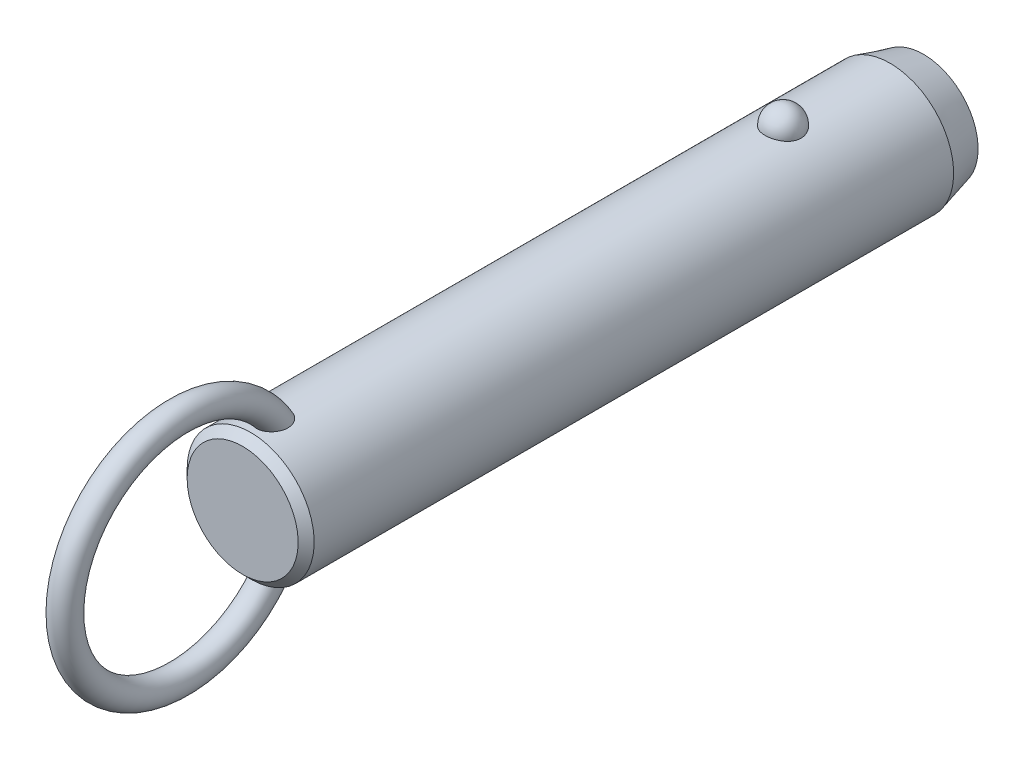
ISO-10303-21;
HEADER;
FILE_DESCRIPTION(('STEP AP214'),'2;1');
FILE_NAME('part.step','',(''),(''),'','','');
FILE_SCHEMA(('AUTOMOTIVE_DESIGN { 1 0 10303 214 1 1 1 1 }'));
ENDSEC;
DATA;
#1=APPLICATION_CONTEXT('core data for automotive mechanical design processes');
#2=APPLICATION_PROTOCOL_DEFINITION('international standard','automotive_design',2000,#1);
#3=PRODUCT_CONTEXT('',#1,'mechanical');
#4=PRODUCT('Part','Part','',(#3));
#5=PRODUCT_RELATED_PRODUCT_CATEGORY('part','',(#4));
#6=PRODUCT_DEFINITION_FORMATION('','',#4);
#7=PRODUCT_DEFINITION_CONTEXT('part definition',#1,'design');
#8=PRODUCT_DEFINITION('design','',#6,#7);
#9=PRODUCT_DEFINITION_SHAPE('','',#8);
#10=(LENGTH_UNIT() NAMED_UNIT(*) SI_UNIT(.MILLI.,.METRE.));
#11=(NAMED_UNIT(*) PLANE_ANGLE_UNIT() SI_UNIT($,.RADIAN.));
#12=(NAMED_UNIT(*) SI_UNIT($,.STERADIAN.) SOLID_ANGLE_UNIT());
#13=UNCERTAINTY_MEASURE_WITH_UNIT(LENGTH_MEASURE(1.E-05),#10,'distance_accuracy_value','');
#14=(GEOMETRIC_REPRESENTATION_CONTEXT(3) GLOBAL_UNCERTAINTY_ASSIGNED_CONTEXT((#13)) GLOBAL_UNIT_ASSIGNED_CONTEXT((#10,
#11,#12)) REPRESENTATION_CONTEXT('',''));
#15=CARTESIAN_POINT('',(0.,0.,0.));
#16=DIRECTION('',(0.,0.,1.));
#17=DIRECTION('',(1.,0.,0.));
#18=AXIS2_PLACEMENT_3D('',#15,#16,#17);
#19=CARTESIAN_POINT('',(0.,0.,68.6));
#20=DIRECTION('',(0.,0.,-1.));
#21=DIRECTION('',(-1.,0.,0.));
#22=AXIS2_PLACEMENT_3D('',#19,#20,#21);
#23=CYLINDRICAL_SURFACE('',#22,9.5);
#24=CARTESIAN_POINT('',(2.67259918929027,9.11631578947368,-2.70000000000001));
#25=CARTESIAN_POINT('',(2.6725968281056,9.11631786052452,-2.54909854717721));
#26=CARTESIAN_POINT('',(2.66030567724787,9.11994722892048,-2.39816735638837));
#27=CARTESIAN_POINT('',(2.6114347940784,9.13405924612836,-2.10058568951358));
#28=CARTESIAN_POINT('',(2.57484658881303,9.14454428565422,-1.95393672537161));
#29=CARTESIAN_POINT('',(2.47830875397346,9.17117631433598,-1.66916069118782));
#30=CARTESIAN_POINT('',(2.41836936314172,9.18732082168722,-1.53102991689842));
#31=CARTESIAN_POINT('',(2.27661331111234,9.22346780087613,-1.26705393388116));
#32=CARTESIAN_POINT('',(2.19479699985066,9.24347021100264,-1.14120852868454));
#33=CARTESIAN_POINT('',(2.01085282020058,9.28522401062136,-0.904632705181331));
#34=CARTESIAN_POINT('',(1.90862396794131,9.30698376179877,-0.793982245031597));
#35=CARTESIAN_POINT('',(1.6867437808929,9.34973971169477,-0.591607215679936));
#36=CARTESIAN_POINT('',(1.56709244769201,9.37073591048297,-0.499882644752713));
#37=CARTESIAN_POINT('',(1.31393976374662,9.40956370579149,-0.338167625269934));
#38=CARTESIAN_POINT('',(1.18048026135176,9.42740444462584,-0.268113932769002));
#39=CARTESIAN_POINT('',(0.903154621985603,9.45799906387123,-0.151390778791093));
#40=CARTESIAN_POINT('',(0.759289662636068,9.47075351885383,-0.104718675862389));
#41=CARTESIAN_POINT('',(0.468074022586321,9.48956256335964,-0.0367633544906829));
#42=CARTESIAN_POINT('',(0.320836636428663,9.49573643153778,-0.0150275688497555));
#43=CARTESIAN_POINT('',(0.0246714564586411,9.50112183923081,0.00396199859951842));
#44=CARTESIAN_POINT('',(-0.124256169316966,9.50033406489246,0.00121819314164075));
#45=CARTESIAN_POINT('',(-0.417264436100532,9.4919475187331,-0.0284441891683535));
#46=CARTESIAN_POINT('',(-0.56138413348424,9.48444885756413,-0.0550074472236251));
#47=CARTESIAN_POINT('',(-0.842986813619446,9.46357853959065,-0.131064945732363));
#48=CARTESIAN_POINT('',(-0.980469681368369,9.450206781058,-0.180559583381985));
#49=CARTESIAN_POINT('',(-1.24585005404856,9.41890822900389,-0.301476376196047));
#50=CARTESIAN_POINT('',(-1.37368611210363,9.40095498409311,-0.373026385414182));
#51=CARTESIAN_POINT('',(-1.61552738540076,9.36242964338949,-0.536025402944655));
#52=CARTESIAN_POINT('',(-1.72953116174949,9.34185727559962,-0.627476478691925));
#53=CARTESIAN_POINT('',(-1.9429225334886,9.29984568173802,-0.829844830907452));
#54=CARTESIAN_POINT('',(-2.04198021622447,9.27839736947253,-0.94110821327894));
#55=CARTESIAN_POINT('',(-2.22026460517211,9.23735994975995,-1.17883414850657));
#56=CARTESIAN_POINT('',(-2.29948985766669,9.21777097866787,-1.30529781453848));
#57=CARTESIAN_POINT('',(-2.43697287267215,9.18238994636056,-1.57158566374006));
#58=CARTESIAN_POINT('',(-2.49497068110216,9.16664569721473,-1.71155057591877));
#59=CARTESIAN_POINT('',(-2.5872073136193,9.14104303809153,-1.99961197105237));
#60=CARTESIAN_POINT('',(-2.62144683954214,9.13118445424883,-2.14770821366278));
#61=CARTESIAN_POINT('',(-2.66521466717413,9.11850622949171,-2.44715424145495));
#62=CARTESIAN_POINT('',(-2.67484831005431,9.11565658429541,-2.59848735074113));
#63=CARTESIAN_POINT('',(-2.66946735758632,9.11723375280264,-2.90067317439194));
#64=CARTESIAN_POINT('',(-2.65445345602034,9.12166036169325,-3.05152590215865));
#65=CARTESIAN_POINT('',(-2.60029711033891,9.13724422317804,-3.34766110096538));
#66=CARTESIAN_POINT('',(-2.56127978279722,9.14836656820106,-3.49296833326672));
#67=CARTESIAN_POINT('',(-2.46018844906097,9.17606676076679,-3.77477535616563));
#68=CARTESIAN_POINT('',(-2.39811349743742,9.1926448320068,-3.9112747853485));
#69=CARTESIAN_POINT('',(-2.25202303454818,9.22952198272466,-4.17244273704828));
#70=CARTESIAN_POINT('',(-2.16788714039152,9.24984129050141,-4.29704106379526));
#71=CARTESIAN_POINT('',(-1.9799408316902,9.29188255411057,-4.53013066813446));
#72=CARTESIAN_POINT('',(-1.87612963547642,9.31360456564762,-4.63862130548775));
#73=CARTESIAN_POINT('',(-1.65105429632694,9.35612959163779,-4.8369029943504));
#74=CARTESIAN_POINT('',(-1.52972405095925,9.37692871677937,-4.92661991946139));
#75=CARTESIAN_POINT('',(-1.27318250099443,9.41518970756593,-5.08429106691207));
#76=CARTESIAN_POINT('',(-1.13797219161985,9.432651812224,-5.15224684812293));
#77=CARTESIAN_POINT('',(-0.859280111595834,9.46208255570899,-5.26371827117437));
#78=CARTESIAN_POINT('',(-0.715925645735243,9.47411833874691,-5.30753421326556));
#79=CARTESIAN_POINT('',(-0.423550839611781,9.4916822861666,-5.37076321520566));
#80=CARTESIAN_POINT('',(-0.2745312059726,9.49721125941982,-5.39017930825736));
#81=CARTESIAN_POINT('',(0.0218446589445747,9.50110860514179,-5.40390587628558));
#82=CARTESIAN_POINT('',(0.16917707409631,9.49961381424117,-5.39869609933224));
#83=CARTESIAN_POINT('',(0.460808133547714,9.48993906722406,-5.36441955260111));
#84=CARTESIAN_POINT('',(0.605106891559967,9.48175936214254,-5.33535367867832));
#85=CARTESIAN_POINT('',(0.886027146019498,9.4596376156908,-5.25435587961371));
#86=CARTESIAN_POINT('',(1.02267710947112,9.44571881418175,-5.20251612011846));
#87=CARTESIAN_POINT('',(1.28523827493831,9.41358993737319,-5.07741549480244));
#88=CARTESIAN_POINT('',(1.41114877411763,9.39537958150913,-5.00415322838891));
#89=CARTESIAN_POINT('',(1.65085227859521,9.3562644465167,-4.83684599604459));
#90=CARTESIAN_POINT('',(1.76442346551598,9.33532178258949,-4.74249218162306));
#91=CARTESIAN_POINT('',(1.97425672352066,9.29321198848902,-4.53620389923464));
#92=CARTESIAN_POINT('',(2.07051582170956,9.27204482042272,-4.42426641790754));
#93=CARTESIAN_POINT('',(2.24490086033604,9.23139221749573,-4.18363183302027));
#94=CARTESIAN_POINT('',(2.32267019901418,9.21194380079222,-4.05466990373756));
#95=CARTESIAN_POINT('',(2.45584092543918,9.1773419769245,-3.78517836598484));
#96=CARTESIAN_POINT('',(2.5112497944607,9.16218713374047,-3.64465264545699));
#97=CARTESIAN_POINT('',(2.59380876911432,9.13913522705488,-3.37104301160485));
#98=CARTESIAN_POINT('',(2.62330266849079,9.13064624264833,-3.23871053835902));
#99=CARTESIAN_POINT('',(2.66269870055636,9.11923566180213,-2.97092664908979));
#100=CARTESIAN_POINT('',(2.67260130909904,9.11631393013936,-2.83547530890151));
#101=CARTESIAN_POINT('',(2.67259918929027,9.11631578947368,-2.70000000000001));
#102=B_SPLINE_CURVE_WITH_KNOTS('',3,(#24,#25,#26,#27,#28,#29,#30,#31,#32,#33,#34,#35,#36,#37,
#38,#39,#40,#41,#42,#43,#44,#45,#46,#47,#48,#49,#50,#51,#52,#53,#54,#55,#56,#57,#58,#59,#60,#61,
#62,#63,#64,#65,#66,#67,#68,#69,#70,#71,#72,#73,#74,#75,#76,#77,#78,#79,#80,#81,#82,#83,#84,#85,
#86,#87,#88,#89,#90,#91,#92,#93,#94,#95,#96,#97,#98,#99,#100,#101),.UNSPECIFIED.,.T.,.F.,(4,2,2,
2,2,2,2,2,2,2,2,2,2,2,2,2,2,2,2,2,2,2,2,2,2,2,2,2,2,2,2,2,2,2,2,2,2,2,4),(0.,0.452217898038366,
0.904593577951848,1.35677112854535,1.80894144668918,2.26340676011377,2.71787203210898,
3.17099820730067,3.62407318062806,4.0687883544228,4.51345969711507,4.95160616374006,
5.38976021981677,5.83050358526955,6.27129275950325,6.72071308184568,7.17016633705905,
7.62495278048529,8.07972578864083,8.53254856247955,8.98535859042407,9.43582813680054,
9.88631615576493,10.3393155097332,10.7923328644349,11.2471065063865,11.7018475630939,
12.150795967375,12.599688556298,13.0398725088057,13.4800399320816,13.9184421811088,
14.3568730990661,14.802202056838,15.2476074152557,15.7010097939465,16.1542603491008,
16.5602594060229,16.966248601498),.UNSPECIFIED.);
#103=CARTESIAN_POINT('',(2.67259918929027,9.11631578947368,-2.70000000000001));
#104=VERTEX_POINT('',#103);
#105=EDGE_CURVE('E41',#104,#104,#102,.T.);
#106=ORIENTED_EDGE('',*,*,#105,.T.);
#107=EDGE_LOOP('',(#106));
#108=FACE_BOUND('',#107,.T.);
#109=CARTESIAN_POINT('',(0.,0.,76.92));
#110=DIRECTION('',(0.,0.,1.));
#111=DIRECTION('',(1.,0.,0.));
#112=AXIS2_PLACEMENT_3D('',#109,#110,#111);
#113=CIRCLE('',#112,9.5);
#114=CARTESIAN_POINT('',(-9.50000000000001,0.,76.92));
#115=VERTEX_POINT('',#114);
#116=EDGE_CURVE('E10',#115,#115,#113,.F.);
#117=ORIENTED_EDGE('',*,*,#116,.T.);
#118=EDGE_LOOP('',(#117));
#119=FACE_BOUND('',#118,.T.);
#120=CARTESIAN_POINT('',(-0.697062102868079,-9.47439269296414,71.2678088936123));
#121=CARTESIAN_POINT('',(-0.799579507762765,-9.46685146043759,71.3074823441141));
#122=CARTESIAN_POINT('',(-0.898575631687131,-9.45788043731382,71.3559309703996));
#123=CARTESIAN_POINT('',(-1.08670047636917,-9.43811593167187,71.4688685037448));
#124=CARTESIAN_POINT('',(-1.17583204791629,-9.42732297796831,71.5333527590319));
#125=CARTESIAN_POINT('',(-1.34179806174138,-9.40513672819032,71.6762099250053));
#126=CARTESIAN_POINT('',(-1.41865133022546,-9.39374438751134,71.754561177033));
#127=CARTESIAN_POINT('',(-1.5586004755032,-9.37154196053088,71.9227524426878));
#128=CARTESIAN_POINT('',(-1.62169476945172,-9.3607319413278,72.0125937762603));
#129=CARTESIAN_POINT('',(-1.73527695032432,-9.34035749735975,72.2045001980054));
#130=CARTESIAN_POINT('',(-1.7852226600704,-9.33085270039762,72.3068910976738));
#131=CARTESIAN_POINT('',(-1.86924997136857,-9.3143834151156,72.518148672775));
#132=CARTESIAN_POINT('',(-1.90332570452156,-9.30741986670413,72.6270177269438));
#133=CARTESIAN_POINT('',(-1.95893603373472,-9.29588482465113,72.8604730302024));
#134=CARTESIAN_POINT('',(-1.97872420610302,-9.29165182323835,72.9854890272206));
#135=CARTESIAN_POINT('',(-2.00062129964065,-9.28695978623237,73.2370805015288));
#136=CARTESIAN_POINT('',(-2.00272284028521,-9.28650232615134,73.363656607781));
#137=CARTESIAN_POINT('',(-1.98958876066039,-9.28932750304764,73.6368157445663));
#138=CARTESIAN_POINT('',(-1.97143366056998,-9.2932400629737,73.7832519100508));
#139=CARTESIAN_POINT('',(-1.91479925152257,-9.30507151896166,74.0720629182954));
#140=CARTESIAN_POINT('',(-1.87629122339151,-9.31299607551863,74.214431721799));
#141=CARTESIAN_POINT('',(-1.77225683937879,-9.33340232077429,74.5151725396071));
#142=CARTESIAN_POINT('',(-1.70334898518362,-9.34641636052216,74.6723691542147));
#143=CARTESIAN_POINT('',(-1.58111062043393,-9.36759153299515,74.8975171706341));
#144=CARTESIAN_POINT('',(-1.53721459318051,-9.37492619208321,74.9707968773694));
#145=CARTESIAN_POINT('',(-1.44302631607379,-9.38988566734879,75.1130740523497));
#146=CARTESIAN_POINT('',(-1.39273721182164,-9.39751033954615,75.1820736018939));
#147=CARTESIAN_POINT('',(-1.26775962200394,-9.41530678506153,75.3369832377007));
#148=CARTESIAN_POINT('',(-1.19052326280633,-9.42548108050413,75.4208712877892));
#149=CARTESIAN_POINT('',(-1.02420241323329,-9.44499825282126,75.5760086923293));
#150=CARTESIAN_POINT('',(-0.935139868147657,-9.45434261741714,75.6472808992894));
#151=CARTESIAN_POINT('',(-0.766610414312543,-9.46930670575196,75.7586955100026));
#152=CARTESIAN_POINT('',(-0.689439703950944,-9.47529223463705,75.8022354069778));
#153=CARTESIAN_POINT('',(-0.528942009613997,-9.48560294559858,75.8763133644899));
#154=CARTESIAN_POINT('',(-0.445620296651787,-9.48992953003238,75.9068624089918));
#155=CARTESIAN_POINT('',(-0.273901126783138,-9.49644161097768,75.9525792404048));
#156=CARTESIAN_POINT('',(-0.185465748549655,-9.49860811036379,75.96761059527));
#157=CARTESIAN_POINT('',(-0.00734541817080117,-9.5004135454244,75.9801494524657));
#158=CARTESIAN_POINT('',(0.0823387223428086,-9.50005405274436,75.9776678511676));
#159=CARTESIAN_POINT('',(0.247679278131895,-9.49708301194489,75.9569959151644));
#160=CARTESIAN_POINT('',(0.323620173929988,-9.49477609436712,75.9409300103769));
#161=CARTESIAN_POINT('',(0.471981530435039,-9.48855917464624,75.8971726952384));
#162=CARTESIAN_POINT('',(0.544400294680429,-9.48464840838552,75.8694757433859));
#163=CARTESIAN_POINT('',(0.70894789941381,-9.47398336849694,75.7928026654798));
#164=CARTESIAN_POINT('',(0.799149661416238,-9.46671310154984,75.7397745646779));
#165=CARTESIAN_POINT('',(0.969783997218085,-9.45076225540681,75.6199731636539));
#166=CARTESIAN_POINT('',(1.05019415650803,-9.44207854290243,75.5531692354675));
#167=CARTESIAN_POINT('',(1.23092343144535,-9.42051459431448,75.3807596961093));
#168=CARTESIAN_POINT('',(1.3265249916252,-9.40733378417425,75.2702619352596));
#169=CARTESIAN_POINT('',(1.49893121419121,-9.38140745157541,75.0355614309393));
#170=CARTESIAN_POINT('',(1.57571616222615,-9.36866239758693,74.9113445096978));
#171=CARTESIAN_POINT('',(1.71285426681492,-9.34457644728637,74.6493891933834));
#172=CARTESIAN_POINT('',(1.77266365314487,-9.33328726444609,74.5113623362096));
#173=CARTESIAN_POINT('',(1.87239208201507,-9.31379209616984,74.2280515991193));
#174=CARTESIAN_POINT('',(1.9123015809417,-9.3055875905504,74.082764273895));
#175=CARTESIAN_POINT('',(1.97604189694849,-9.29228394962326,73.7620281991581));
#176=CARTESIAN_POINT('',(1.99587438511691,-9.28797202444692,73.5857248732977));
#177=CARTESIAN_POINT('',(2.0029570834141,-9.28645519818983,73.2324146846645));
#178=CARTESIAN_POINT('',(1.99025930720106,-9.28923895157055,73.0554093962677));
#179=CARTESIAN_POINT('',(1.93735479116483,-9.30038134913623,72.7563381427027));
#180=CARTESIAN_POINT('',(1.90576827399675,-9.30697680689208,72.6326679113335));
#181=CARTESIAN_POINT('',(1.82287484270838,-9.32356855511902,72.392329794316));
#182=CARTESIAN_POINT('',(1.77158213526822,-9.33356239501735,72.2756569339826));
#183=CARTESIAN_POINT('',(1.64885744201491,-9.35602275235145,72.0527061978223));
#184=CARTESIAN_POINT('',(1.57730995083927,-9.36850332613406,71.9464927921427));
#185=CARTESIAN_POINT('',(1.4154326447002,-9.39431873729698,71.7495530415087));
#186=CARTESIAN_POINT('',(1.32510883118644,-9.40765330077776,71.6588217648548));
#187=CARTESIAN_POINT('',(1.13846223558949,-9.43195720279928,71.5050334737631));
#188=CARTESIAN_POINT('',(1.04369890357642,-9.44302894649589,71.4400947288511));
#189=CARTESIAN_POINT('',(0.843965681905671,-9.46296805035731,71.3280388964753));
#190=CARTESIAN_POINT('',(0.739000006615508,-9.47183631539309,71.2809144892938));
#191=CARTESIAN_POINT('',(0.528175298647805,-9.48586140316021,71.2081173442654));
#192=CARTESIAN_POINT('',(0.422686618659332,-9.49119633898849,71.1814024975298));
#193=CARTESIAN_POINT('',(0.208590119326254,-9.49831365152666,71.1460137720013));
#194=CARTESIAN_POINT('',(0.0999817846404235,-9.500095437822,71.1373428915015));
#195=CARTESIAN_POINT('',(-0.126104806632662,-9.49988861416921,71.1383501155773));
#196=CARTESIAN_POINT('',(-0.24357872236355,-9.49757821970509,71.1495942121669));
#197=CARTESIAN_POINT('',(-0.474390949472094,-9.48885165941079,71.193167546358));
#198=CARTESIAN_POINT('',(-0.587729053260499,-9.48243528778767,71.2254978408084));
#199=CARTESIAN_POINT('',(-0.697062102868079,-9.47439269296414,71.2678088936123));
#200=B_SPLINE_CURVE_WITH_KNOTS('',3,(#120,#121,#122,#123,#124,#125,#126,#127,#128,#129,#130,
#131,#132,#133,#134,#135,#136,#137,#138,#139,#140,#141,#142,#143,#144,#145,#146,#147,#148,#149,
#150,#151,#152,#153,#154,#155,#156,#157,#158,#159,#160,#161,#162,#163,#164,#165,#166,#167,#168,
#169,#170,#171,#172,#173,#174,#175,#176,#177,#178,#179,#180,#181,#182,#183,#184,#185,#186,#187,
#188,#189,#190,#191,#192,#193,#194,#195,#196,#197,#198,#199),.UNSPECIFIED.,.T.,.F.,(4,2,2,2,2,2,
2,2,2,2,2,2,2,2,2,2,2,2,2,2,2,2,2,2,2,2,2,2,2,2,2,2,2,2,2,2,2,2,2,4),(0.,0.330119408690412,
0.660143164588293,0.989655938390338,1.31920659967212,1.66074728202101,2.00241415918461,
2.38088696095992,2.7595176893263,3.20065679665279,3.6424200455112,4.15620996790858,
4.4131416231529,4.66994734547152,5.01228664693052,5.35399933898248,5.61943037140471,
5.88463652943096,6.15215502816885,6.41950709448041,6.65144391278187,6.88349136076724,
7.19641200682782,7.51003602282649,7.94779711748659,8.38601491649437,8.83699707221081,
9.28819530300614,9.81778662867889,10.3465317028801,10.7284172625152,11.110028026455,
11.4938603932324,11.8775702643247,12.2220189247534,12.5663259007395,12.8915939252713,
13.2169159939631,13.5689650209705,13.9210316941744),.UNSPECIFIED.);
#201=CARTESIAN_POINT('',(-0.697062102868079,-9.47439269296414,71.2678088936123));
#202=VERTEX_POINT('',#201);
#203=EDGE_CURVE('E60',#202,#202,#200,.T.);
#204=ORIENTED_EDGE('',*,*,#203,.T.);
#205=EDGE_LOOP('',(#204));
#206=FACE_BOUND('',#205,.T.);
#207=CARTESIAN_POINT('',(-0.697062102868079,9.47439269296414,71.2678088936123));
#208=CARTESIAN_POINT('',(-0.59779262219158,9.48169483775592,71.2293956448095));
#209=CARTESIAN_POINT('',(-0.495106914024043,9.48766580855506,71.1991682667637));
#210=CARTESIAN_POINT('',(-0.285876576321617,9.49627648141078,71.1560327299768));
#211=CARTESIAN_POINT('',(-0.179324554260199,9.49890941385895,71.1431597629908));
#212=CARTESIAN_POINT('',(0.0344157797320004,9.50053798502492,71.1351666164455));
#213=CARTESIAN_POINT('',(0.141603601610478,9.49953613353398,71.1400341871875));
#214=CARTESIAN_POINT('',(0.353563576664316,9.49401038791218,71.1673654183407));
#215=CARTESIAN_POINT('',(0.458336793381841,9.48948807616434,71.18982117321));
#216=CARTESIAN_POINT('',(0.66249373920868,9.4774236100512,71.2516719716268));
#217=CARTESIAN_POINT('',(0.761881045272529,9.46988348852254,71.2910556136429));
#218=CARTESIAN_POINT('',(0.952608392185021,9.45260382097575,71.3856342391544));
#219=CARTESIAN_POINT('',(1.04394806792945,9.44286417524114,71.4408299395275));
#220=CARTESIAN_POINT('',(1.21712767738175,9.42211760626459,71.5660662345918));
#221=CARTESIAN_POINT('',(1.29885671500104,9.41109835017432,71.6362579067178));
#222=CARTESIAN_POINT('',(1.44978975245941,9.38903310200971,71.788980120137));
#223=CARTESIAN_POINT('',(1.51899278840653,9.37798710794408,71.8715116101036));
#224=CARTESIAN_POINT('',(1.64602857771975,9.35654375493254,72.0497763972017));
#225=CARTESIAN_POINT('',(1.70333052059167,9.34618688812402,72.1458916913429));
#226=CARTESIAN_POINT('',(1.80259341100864,9.32755128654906,72.345897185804));
#227=CARTESIAN_POINT('',(1.84454942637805,9.31927322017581,72.4497898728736));
#228=CARTESIAN_POINT('',(1.91637039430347,9.30478365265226,72.6722131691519));
#229=CARTESIAN_POINT('',(1.944805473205,9.29882552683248,72.7912192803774));
#230=CARTESIAN_POINT('',(1.98449865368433,9.29043398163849,73.0321436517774));
#231=CARTESIAN_POINT('',(1.99574908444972,9.28800213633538,73.1540631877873));
#232=CARTESIAN_POINT('',(2.00275141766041,9.28649645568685,73.4169324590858));
#233=CARTESIAN_POINT('',(1.99588238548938,9.28799035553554,73.5579529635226));
#234=CARTESIAN_POINT('',(1.96270559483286,9.29505517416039,73.8376217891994));
#235=CARTESIAN_POINT('',(1.93637872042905,9.30063010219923,73.976267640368));
#236=CARTESIAN_POINT('',(1.85949176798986,9.31633564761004,74.2725616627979));
#237=CARTESIAN_POINT('',(1.80549792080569,9.3270926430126,74.4292907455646));
#238=CARTESIAN_POINT('',(1.67376869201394,9.3516306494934,74.7322840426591));
#239=CARTESIAN_POINT('',(1.59603181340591,9.36541185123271,74.8785475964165));
#240=CARTESIAN_POINT('',(1.4360277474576,9.39110706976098,75.1258138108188));
#241=CARTESIAN_POINT('',(1.35831795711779,9.40278656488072,75.229791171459));
#242=CARTESIAN_POINT('',(1.18774483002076,9.42585025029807,75.4245347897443));
#243=CARTESIAN_POINT('',(1.09490932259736,9.43723493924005,75.5153247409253));
#244=CARTESIAN_POINT('',(0.921110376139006,9.45552616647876,75.6562033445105));
#245=CARTESIAN_POINT('',(0.843738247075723,9.46281058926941,75.7106563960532));
#246=CARTESIAN_POINT('',(0.681245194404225,9.47589120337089,75.8067117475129));
#247=CARTESIAN_POINT('',(0.596135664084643,9.48168953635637,75.8483325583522));
#248=CARTESIAN_POINT('',(0.433779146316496,9.49038144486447,75.9100899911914));
#249=CARTESIAN_POINT('',(0.357459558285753,9.49359170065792,75.9326013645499));
#250=CARTESIAN_POINT('',(0.202074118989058,9.49816761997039,75.9645745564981));
#251=CARTESIAN_POINT('',(0.123010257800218,9.49953459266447,75.9740456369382));
#252=CARTESIAN_POINT('',(-0.0357372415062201,9.50026497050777,75.9791143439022));
#253=CARTESIAN_POINT('',(-0.115421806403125,9.49962433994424,75.9746840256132));
#254=CARTESIAN_POINT('',(-0.272823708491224,9.49640854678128,75.9522962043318));
#255=CARTESIAN_POINT('',(-0.350540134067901,9.4938325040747,75.9343325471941));
#256=CARTESIAN_POINT('',(-0.500580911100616,9.4870946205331,75.8868028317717));
#257=CARTESIAN_POINT('',(-0.57297929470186,9.48296359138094,75.8574618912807));
#258=CARTESIAN_POINT('',(-0.712864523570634,9.47347609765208,75.7890087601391));
#259=CARTESIAN_POINT('',(-0.780349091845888,9.46811906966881,75.7498920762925));
#260=CARTESIAN_POINT('',(-0.946309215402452,9.45329720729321,75.639432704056));
#261=CARTESIAN_POINT('',(-1.04090230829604,9.44321512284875,75.5623297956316));
#262=CARTESIAN_POINT('',(-1.21661929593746,9.42219227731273,75.3940971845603));
#263=CARTESIAN_POINT('',(-1.29770519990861,9.41124921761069,75.3029292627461));
#264=CARTESIAN_POINT('',(-1.47319646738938,9.38563439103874,75.0761621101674));
#265=CARTESIAN_POINT('',(-1.56208878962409,9.37102009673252,74.9362895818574));
#266=CARTESIAN_POINT('',(-1.71623987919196,9.34401559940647,74.6439503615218));
#267=CARTESIAN_POINT('',(-1.78147866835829,9.33162728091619,74.491473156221));
#268=CARTESIAN_POINT('',(-1.88853837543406,9.31055541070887,74.1756470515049));
#269=CARTESIAN_POINT('',(-1.92998995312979,9.30193076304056,74.0121685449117));
#270=CARTESIAN_POINT('',(-1.98590726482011,9.29015757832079,73.6805268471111));
#271=CARTESIAN_POINT('',(-2.0004070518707,9.2870021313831,73.5123698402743));
#272=CARTESIAN_POINT('',(-1.99964701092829,9.28716218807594,73.2050806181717));
#273=CARTESIAN_POINT('',(-1.98908145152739,9.28945704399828,73.0659362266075));
#274=CARTESIAN_POINT('',(-1.94566294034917,9.29865169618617,72.7911539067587));
#275=CARTESIAN_POINT('',(-1.91282062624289,9.30554929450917,72.655514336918));
#276=CARTESIAN_POINT('',(-1.84582133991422,9.31898248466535,72.4578026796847));
#277=CARTESIAN_POINT('',(-1.82038084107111,9.32400364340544,72.3925830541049));
#278=CARTESIAN_POINT('',(-1.7635051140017,9.33492884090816,72.2649033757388));
#279=CARTESIAN_POINT('',(-1.73207305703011,9.34083241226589,72.2024418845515));
#280=CARTESIAN_POINT('',(-1.6632424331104,9.353333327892,72.0809407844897));
#281=CARTESIAN_POINT('',(-1.62584239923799,9.35993084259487,72.021902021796));
#282=CARTESIAN_POINT('',(-1.54527678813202,9.37356864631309,71.9079875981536));
#283=CARTESIAN_POINT('',(-1.50211241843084,9.38060884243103,71.8531110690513));
#284=CARTESIAN_POINT('',(-1.37681147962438,9.40004442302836,71.7099619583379));
#285=CARTESIAN_POINT('',(-1.28916358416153,9.41261047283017,71.6264295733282));
#286=CARTESIAN_POINT('',(-1.09996826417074,9.43658180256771,71.4772360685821));
#287=CARTESIAN_POINT('',(-0.998461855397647,9.44799034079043,71.4115238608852));
#288=CARTESIAN_POINT('',(-0.860188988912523,9.46103017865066,71.3394367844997));
#289=CARTESIAN_POINT('',(-0.828141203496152,9.46389141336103,71.3238511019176));
#290=CARTESIAN_POINT('',(-0.763210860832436,9.46934915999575,71.2944734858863));
#291=CARTESIAN_POINT('',(-0.730328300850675,9.47194567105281,71.2806815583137));
#292=CARTESIAN_POINT('',(-0.697062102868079,9.47439269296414,71.2678088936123));
#293=B_SPLINE_CURVE_WITH_KNOTS('',3,(#207,#208,#209,#210,#211,#212,#213,#214,#215,#216,#217,
#218,#219,#220,#221,#222,#223,#224,#225,#226,#227,#228,#229,#230,#231,#232,#233,#234,#235,#236,
#237,#238,#239,#240,#241,#242,#243,#244,#245,#246,#247,#248,#249,#250,#251,#252,#253,#254,#255,
#256,#257,#258,#259,#260,#261,#262,#263,#264,#265,#266,#267,#268,#269,#270,#271,#272,#273,#274,
#275,#276,#277,#278,#279,#280,#281,#282,#283,#284,#285,#286,#287,#288,#289,#290,#291,#292),
.UNSPECIFIED.,.T.,.F.,(4,2,2,2,2,2,2,2,2,2,2,2,2,2,2,2,2,2,2,2,2,2,2,2,2,2,2,2,2,2,2,2,2,2,2,2,
2,2,2,2,2,2,4),(0.,0.319942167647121,0.640532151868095,0.960900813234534,1.28112555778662,
1.60113495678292,1.92115886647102,2.24457323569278,2.56801248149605,2.90371927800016,
3.23953387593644,3.60560313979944,3.97183576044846,4.39383693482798,4.81625324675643,
5.31257045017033,5.80891895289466,6.19868344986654,6.58773876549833,6.87145417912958,
7.15475838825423,7.3926375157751,7.63034760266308,7.86853584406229,8.10683246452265,
8.3406366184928,8.57454843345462,8.93983939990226,9.30614105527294,9.8026666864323,
10.2996107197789,10.8040753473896,11.3079021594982,11.7249776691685,12.1418541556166,
12.3521485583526,12.562331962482,12.7725671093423,12.9827582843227,13.3458276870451,
13.7078449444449,13.8150604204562,13.9222762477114),.UNSPECIFIED.);
#294=CARTESIAN_POINT('',(-0.697062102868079,9.47439269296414,71.2678088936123));
#295=VERTEX_POINT('',#294);
#296=EDGE_CURVE('E67',#295,#295,#293,.T.);
#297=ORIENTED_EDGE('',*,*,#296,.T.);
#298=EDGE_LOOP('',(#297));
#299=FACE_BOUND('',#298,.T.);
#300=CARTESIAN_POINT('',(0.,0.,-18.6999999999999));
#301=DIRECTION('',(0.,0.,-1.));
#302=DIRECTION('',(-1.,0.,0.));
#303=AXIS2_PLACEMENT_3D('',#300,#301,#302);
#304=CIRCLE('',#303,9.5);
#305=CARTESIAN_POINT('',(-9.5,0.,-18.6999999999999));
#306=VERTEX_POINT('',#305);
#307=EDGE_CURVE('E57',#306,#306,#304,.F.);
#308=ORIENTED_EDGE('',*,*,#307,.T.);
#309=EDGE_LOOP('',(#308));
#310=FACE_BOUND('',#309,.T.);
#311=ADVANCED_FACE('F37',(#108,#119,#206,#299,#310),#23,.T.);
#312=CARTESIAN_POINT('',(0.,0.,-23.7));
#313=DIRECTION('',(0.,0.,-1.));
#314=DIRECTION('',(-1.,0.,0.));
#315=AXIS2_PLACEMENT_3D('',#312,#313,#314);
#316=PLANE('',#315);
#317=CARTESIAN_POINT('',(0.,0.,-23.7));
#318=DIRECTION('',(0.,0.,-1.));
#319=DIRECTION('',(-1.,0.,0.));
#320=AXIS2_PLACEMENT_3D('',#317,#318,#319);
#321=CIRCLE('',#320,8.16025403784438);
#322=CARTESIAN_POINT('',(-8.16025403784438,0.,-23.7));
#323=VERTEX_POINT('',#322);
#324=EDGE_CURVE('E66',#323,#323,#321,.T.);
#325=ORIENTED_EDGE('',*,*,#324,.T.);
#326=EDGE_LOOP('',(#325));
#327=FACE_BOUND('',#326,.T.);
#328=ADVANCED_FACE('F85',(#327),#316,.T.);
#329=CARTESIAN_POINT('',(0.,0.,-23.7));
#330=DIRECTION('',(0.,0.,1.));
#331=DIRECTION('',(1.,0.,0.));
#332=AXIS2_PLACEMENT_3D('',#329,#330,#331);
#333=CONICAL_SURFACE('',#332,8.16025403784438,0.261799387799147);
#334=ORIENTED_EDGE('',*,*,#307,.F.);
#335=EDGE_LOOP('',(#334));
#336=FACE_BOUND('',#335,.T.);
#337=ORIENTED_EDGE('',*,*,#324,.F.);
#338=EDGE_LOOP('',(#337));
#339=FACE_BOUND('',#338,.T.);
#340=ADVANCED_FACE('F83',(#336,#339),#333,.T.);
#341=CARTESIAN_POINT('',(0.,0.,78.12));
#342=DIRECTION('',(0.,0.,1.));
#343=DIRECTION('',(1.,0.,0.));
#344=AXIS2_PLACEMENT_3D('',#341,#342,#343);
#345=PLANE('',#344);
#346=CARTESIAN_POINT('',(0.,0.,78.12));
#347=DIRECTION('',(0.,0.,1.));
#348=DIRECTION('',(1.,0.,0.));
#349=AXIS2_PLACEMENT_3D('',#346,#347,#348);
#350=CIRCLE('',#349,8.29999999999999);
#351=CARTESIAN_POINT('',(-8.3,0.,78.12));
#352=VERTEX_POINT('',#351);
#353=EDGE_CURVE('E50',#352,#352,#350,.T.);
#354=ORIENTED_EDGE('',*,*,#353,.T.);
#355=EDGE_LOOP('',(#354));
#356=FACE_BOUND('',#355,.T.);
#357=ADVANCED_FACE('F77',(#356),#345,.T.);
#358=CARTESIAN_POINT('',(0.,0.,87.65));
#359=DIRECTION('',(1.,0.,0.));
#360=DIRECTION('',(0.,0.,-1.));
#361=AXIS2_PLACEMENT_3D('',#358,#359,#360);
#362=TOROIDAL_SURFACE('',#361,17.05,2.);
#363=ORIENTED_EDGE('',*,*,#296,.F.);
#364=EDGE_LOOP('',(#363));
#365=FACE_BOUND('',#364,.T.);
#366=ORIENTED_EDGE('',*,*,#203,.F.);
#367=EDGE_LOOP('',(#366));
#368=FACE_BOUND('',#367,.T.);
#369=ADVANCED_FACE('F73',(#365,#368),#362,.T.);
#370=CARTESIAN_POINT('',(0.,0.,78.12));
#371=DIRECTION('',(0.,0.,-1.));
#372=DIRECTION('',(-1.,0.,0.));
#373=AXIS2_PLACEMENT_3D('',#370,#371,#372);
#374=CONICAL_SURFACE('',#373,8.29999999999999,0.785398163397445);
#375=CARTESIAN_POINT('',(-9.50000000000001,0.,76.92));
#376=CARTESIAN_POINT('',(-9.48750000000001,0.,76.9325));
#377=CARTESIAN_POINT('',(-9.47500000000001,0.,76.945));
#378=CARTESIAN_POINT('',(-9.45,0.,76.97));
#379=CARTESIAN_POINT('',(-9.43750000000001,0.,76.9825));
#380=CARTESIAN_POINT('',(-9.41250000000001,0.,77.0075));
#381=CARTESIAN_POINT('',(-9.40000000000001,0.,77.02));
#382=CARTESIAN_POINT('',(-9.37500000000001,0.,77.045));
#383=CARTESIAN_POINT('',(-9.36250000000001,0.,77.0575));
#384=CARTESIAN_POINT('',(-9.33750000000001,0.,77.0825));
#385=CARTESIAN_POINT('',(-9.325,0.,77.095));
#386=CARTESIAN_POINT('',(-9.3,0.,77.12));
#387=CARTESIAN_POINT('',(-9.2875,0.,77.1325));
#388=CARTESIAN_POINT('',(-9.2625,0.,77.1575));
#389=CARTESIAN_POINT('',(-9.25000000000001,0.,77.17));
#390=CARTESIAN_POINT('',(-9.225,0.,77.195));
#391=CARTESIAN_POINT('',(-9.2125,0.,77.2075));
#392=CARTESIAN_POINT('',(-9.1875,0.,77.2325));
#393=CARTESIAN_POINT('',(-9.175,0.,77.245));
#394=CARTESIAN_POINT('',(-9.15000000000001,0.,77.27));
#395=CARTESIAN_POINT('',(-9.1375,0.,77.2825));
#396=CARTESIAN_POINT('',(-9.1125,0.,77.3075));
#397=CARTESIAN_POINT('',(-9.1,0.,77.32));
#398=CARTESIAN_POINT('',(-9.075,0.,77.345));
#399=CARTESIAN_POINT('',(-9.0625,0.,77.3575));
#400=CARTESIAN_POINT('',(-9.0375,0.,77.3825));
#401=CARTESIAN_POINT('',(-9.025,0.,77.395));
#402=CARTESIAN_POINT('',(-9.,0.,77.42));
#403=CARTESIAN_POINT('',(-8.9875,0.,77.4325));
#404=CARTESIAN_POINT('',(-8.9625,0.,77.4575));
#405=CARTESIAN_POINT('',(-8.95,0.,77.47));
#406=CARTESIAN_POINT('',(-8.925,0.,77.495));
#407=CARTESIAN_POINT('',(-8.9125,0.,77.5075));
#408=CARTESIAN_POINT('',(-8.8875,0.,77.5325));
#409=CARTESIAN_POINT('',(-8.875,0.,77.545));
#410=CARTESIAN_POINT('',(-8.85,0.,77.57));
#411=CARTESIAN_POINT('',(-8.8375,0.,77.5825));
#412=CARTESIAN_POINT('',(-8.8125,0.,77.6075));
#413=CARTESIAN_POINT('',(-8.8,0.,77.62));
#414=CARTESIAN_POINT('',(-8.775,0.,77.645));
#415=CARTESIAN_POINT('',(-8.7625,0.,77.6575));
#416=CARTESIAN_POINT('',(-8.7375,0.,77.6825));
#417=CARTESIAN_POINT('',(-8.725,0.,77.695));
#418=CARTESIAN_POINT('',(-8.7,0.,77.72));
#419=CARTESIAN_POINT('',(-8.6875,0.,77.7325));
#420=CARTESIAN_POINT('',(-8.6625,0.,77.7575));
#421=CARTESIAN_POINT('',(-8.65,0.,77.77));
#422=CARTESIAN_POINT('',(-8.625,0.,77.795));
#423=CARTESIAN_POINT('',(-8.6125,0.,77.8075));
#424=CARTESIAN_POINT('',(-8.5875,0.,77.8325));
#425=CARTESIAN_POINT('',(-8.575,0.,77.845));
#426=CARTESIAN_POINT('',(-8.55,0.,77.87));
#427=CARTESIAN_POINT('',(-8.5375,0.,77.8825));
#428=CARTESIAN_POINT('',(-8.5125,0.,77.9075));
#429=CARTESIAN_POINT('',(-8.5,0.,77.92));
#430=CARTESIAN_POINT('',(-8.475,0.,77.945));
#431=CARTESIAN_POINT('',(-8.4625,0.,77.9575));
#432=CARTESIAN_POINT('',(-8.43749999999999,0.,77.9825));
#433=CARTESIAN_POINT('',(-8.425,0.,77.995));
#434=CARTESIAN_POINT('',(-8.4,0.,78.02));
#435=CARTESIAN_POINT('',(-8.3875,0.,78.0325));
#436=CARTESIAN_POINT('',(-8.3625,0.,78.0575));
#437=CARTESIAN_POINT('',(-8.35,0.,78.07));
#438=CARTESIAN_POINT('',(-8.32499999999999,0.,78.095));
#439=CARTESIAN_POINT('',(-8.31249999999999,0.,78.1075));
#440=CARTESIAN_POINT('',(-8.3,0.,78.12));
#441=B_SPLINE_CURVE_WITH_KNOTS('',3,(#375,#376,#377,#378,#379,#380,#381,#382,#383,#384,#385,
#386,#387,#388,#389,#390,#391,#392,#393,#394,#395,#396,#397,#398,#399,#400,#401,#402,#403,#404,
#405,#406,#407,#408,#409,#410,#411,#412,#413,#414,#415,#416,#417,#418,#419,#420,#421,#422,#423,
#424,#425,#426,#427,#428,#429,#430,#431,#432,#433,#434,#435,#436,#437,#438,#439,#440),
.UNSPECIFIED.,.F.,.F.,(4,2,2,2,2,2,2,2,2,2,2,2,2,2,2,2,2,2,2,2,2,2,2,2,2,2,2,2,2,2,2,2,4),(0.,
0.0530330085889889,0.106066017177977,0.159099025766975,0.212132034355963,0.265165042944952,
0.318198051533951,0.371231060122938,0.424264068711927,0.477297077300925,0.530330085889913,
0.583363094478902,0.6363961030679,0.689429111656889,0.742462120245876,0.795495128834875,
0.848528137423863,0.901561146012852,0.95459415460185,1.00762716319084,1.06066017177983,
1.11369318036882,1.16672618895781,1.2197591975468,1.2727922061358,1.32582521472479,
1.37885822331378,1.43189123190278,1.48492424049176,1.53795724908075,1.59099025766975,
1.64402326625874,1.69705627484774),.UNSPECIFIED.);
#442=EDGE_CURVE('BSEAM39',#115,#352,#441,.T.);
#443=ORIENTED_EDGE('',*,*,#116,.F.);
#444=ORIENTED_EDGE('',*,*,#353,.F.);
#445=ORIENTED_EDGE('',*,*,#442,.T.);
#446=ORIENTED_EDGE('',*,*,#442,.F.);
#447=EDGE_LOOP('',(#443,#445,#444,#446));
#448=FACE_BOUND('',#447,.T.);
#449=ADVANCED_FACE('F39',(#448),#374,.T.);
#450=CARTESIAN_POINT('',(0.,9.5,-2.70000000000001));
#451=DIRECTION('',(0.,1.,0.));
#452=DIRECTION('',(0.,0.,-1.));
#453=AXIS2_PLACEMENT_3D('',#450,#451,#452);
#454=SPHERICAL_SURFACE('',#453,2.7);
#455=ORIENTED_EDGE('',*,*,#105,.F.);
#456=EDGE_LOOP('',(#455));
#457=FACE_BOUND('',#456,.T.);
#458=ADVANCED_FACE('F79',(#457),#454,.T.);
#459=CLOSED_SHELL('',(#311,#328,#340,#357,#369,#449,#458));
#460=MANIFOLD_SOLID_BREP('B2',#459);
#461=ADVANCED_BREP_SHAPE_REPRESENTATION('',(#18,#460),#14);
#462=SHAPE_DEFINITION_REPRESENTATION(#9,#461);
ENDSEC;
END-ISO-10303-21;
